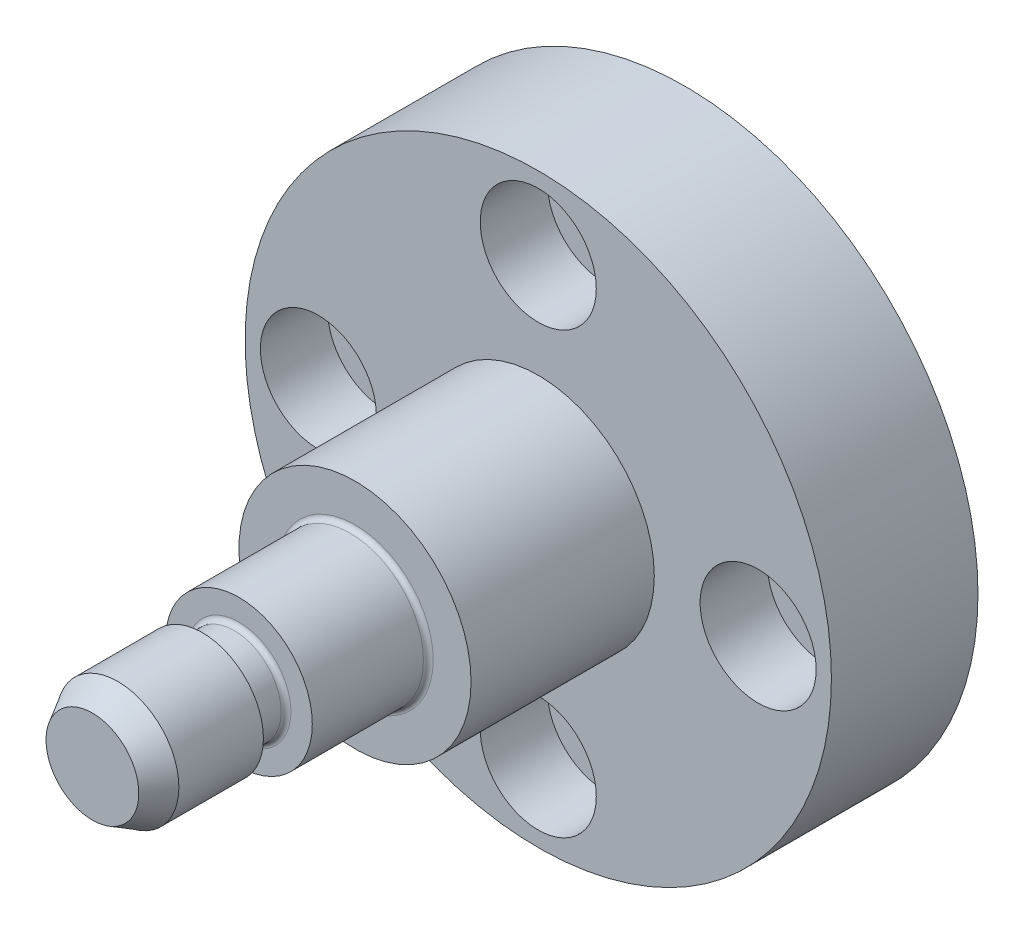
ISO-10303-21;
HEADER;
FILE_DESCRIPTION(('STEP AP214'),'2;1');
FILE_NAME('part.step','',(''),(''),'','','');
FILE_SCHEMA(('AUTOMOTIVE_DESIGN { 1 0 10303 214 1 1 1 1 }'));
ENDSEC;
DATA;
#1=APPLICATION_CONTEXT('core data for automotive mechanical design processes');
#2=APPLICATION_PROTOCOL_DEFINITION('international standard','automotive_design',2000,#1);
#3=PRODUCT_CONTEXT('',#1,'mechanical');
#4=PRODUCT('Part','Part','',(#3));
#5=PRODUCT_RELATED_PRODUCT_CATEGORY('part','',(#4));
#6=PRODUCT_DEFINITION_FORMATION('','',#4);
#7=PRODUCT_DEFINITION_CONTEXT('part definition',#1,'design');
#8=PRODUCT_DEFINITION('design','',#6,#7);
#9=PRODUCT_DEFINITION_SHAPE('','',#8);
#10=(LENGTH_UNIT() NAMED_UNIT(*) SI_UNIT(.MILLI.,.METRE.));
#11=(NAMED_UNIT(*) PLANE_ANGLE_UNIT() SI_UNIT($,.RADIAN.));
#12=(NAMED_UNIT(*) SI_UNIT($,.STERADIAN.) SOLID_ANGLE_UNIT());
#13=UNCERTAINTY_MEASURE_WITH_UNIT(LENGTH_MEASURE(1.E-05),#10,'distance_accuracy_value','');
#14=(GEOMETRIC_REPRESENTATION_CONTEXT(3) GLOBAL_UNCERTAINTY_ASSIGNED_CONTEXT((#13)) GLOBAL_UNIT_ASSIGNED_CONTEXT((#10,
#11,#12)) REPRESENTATION_CONTEXT('',''));
#15=CARTESIAN_POINT('',(0.,0.,0.));
#16=DIRECTION('',(0.,0.,1.));
#17=DIRECTION('',(1.,0.,0.));
#18=AXIS2_PLACEMENT_3D('',#15,#16,#17);
#19=CARTESIAN_POINT('',(-3.8456,-3.858832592,48.5));
#20=DIRECTION('',(0.,0.,1.));
#21=DIRECTION('',(1.,0.,0.));
#22=AXIS2_PLACEMENT_3D('',#19,#20,#21);
#23=PLANE('',#22);
#24=CARTESIAN_POINT('',(0.,0.,48.5));
#25=DIRECTION('',(0.,0.,-1.));
#26=DIRECTION('',(-1.,0.,0.));
#27=AXIS2_PLACEMENT_3D('',#24,#25,#26);
#28=CIRCLE('',#27,3.8);
#29=CARTESIAN_POINT('',(-3.8,0.,48.5));
#30=VERTEX_POINT('',#29);
#31=EDGE_CURVE('E16',#30,#30,#28,.T.);
#32=ORIENTED_EDGE('',*,*,#31,.F.);
#33=EDGE_LOOP('',(#32));
#34=FACE_BOUND('',#33,.T.);
#35=ADVANCED_FACE('F12',(#34),#23,.T.);
#36=CARTESIAN_POINT('',(0.,0.,48.5));
#37=DIRECTION('',(0.,0.,-1.));
#38=DIRECTION('',(-1.,0.,0.));
#39=AXIS2_PLACEMENT_3D('',#36,#37,#38);
#40=CONICAL_SURFACE('',#39,3.8,0.523598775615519);
#41=ORIENTED_EDGE('',*,*,#31,.T.);
#42=EDGE_LOOP('',(#41));
#43=FACE_BOUND('',#42,.T.);
#44=CARTESIAN_POINT('',(0.,0.,46.421539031));
#45=DIRECTION('',(0.,0.,1.));
#46=DIRECTION('',(1.,0.,0.));
#47=AXIS2_PLACEMENT_3D('',#44,#45,#46);
#48=CIRCLE('',#47,5.);
#49=CARTESIAN_POINT('',(5.,0.,46.421539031));
#50=VERTEX_POINT('',#49);
#51=EDGE_CURVE('E28',#50,#50,#48,.F.);
#52=ORIENTED_EDGE('',*,*,#51,.F.);
#53=EDGE_LOOP('',(#52));
#54=FACE_BOUND('',#53,.T.);
#55=ADVANCED_FACE('F107',(#43,#54),#40,.T.);
#56=CARTESIAN_POINT('',(0.,0.,39.5));
#57=DIRECTION('',(0.,0.,1.));
#58=DIRECTION('',(1.,0.,0.));
#59=AXIS2_PLACEMENT_3D('',#56,#57,#58);
#60=CYLINDRICAL_SURFACE('',#59,5.);
#61=CARTESIAN_POINT('',(0.,0.,39.5));
#62=DIRECTION('',(0.,0.,1.));
#63=DIRECTION('',(1.,0.,0.));
#64=AXIS2_PLACEMENT_3D('',#61,#62,#63);
#65=CIRCLE('',#64,5.);
#66=CARTESIAN_POINT('',(5.,0.,39.5));
#67=VERTEX_POINT('',#66);
#68=EDGE_CURVE('E97',#67,#67,#65,.F.);
#69=ORIENTED_EDGE('',*,*,#68,.F.);
#70=EDGE_LOOP('',(#69));
#71=FACE_BOUND('',#70,.T.);
#72=ORIENTED_EDGE('',*,*,#51,.T.);
#73=EDGE_LOOP('',(#72));
#74=FACE_BOUND('',#73,.T.);
#75=ADVANCED_FACE('F117',(#71,#74),#60,.T.);
#76=CARTESIAN_POINT('',(5.06,-5.077411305,39.5));
#77=DIRECTION('',(0.,0.,-1.));
#78=DIRECTION('',(-1.,0.,0.));
#79=AXIS2_PLACEMENT_3D('',#76,#77,#78);
#80=PLANE('',#79);
#81=CARTESIAN_POINT('',(0.,0.,39.5));
#82=DIRECTION('',(0.,0.,1.));
#83=DIRECTION('',(1.,0.,0.));
#84=AXIS2_PLACEMENT_3D('',#81,#82,#83);
#85=CIRCLE('',#84,3.85);
#86=CARTESIAN_POINT('',(3.85,0.,39.5));
#87=VERTEX_POINT('',#86);
#88=EDGE_CURVE('E95',#87,#87,#85,.F.);
#89=ORIENTED_EDGE('',*,*,#88,.F.);
#90=EDGE_LOOP('',(#89));
#91=FACE_BOUND('',#90,.T.);
#92=ORIENTED_EDGE('',*,*,#68,.T.);
#93=EDGE_LOOP('',(#92));
#94=FACE_BOUND('',#93,.T.);
#95=ADVANCED_FACE('F182',(#91,#94),#80,.T.);
#96=CARTESIAN_POINT('',(0.,0.,36.9));
#97=DIRECTION('',(0.,0.,1.));
#98=DIRECTION('',(1.,0.,0.));
#99=AXIS2_PLACEMENT_3D('',#96,#97,#98);
#100=CYLINDRICAL_SURFACE('',#99,3.85);
#101=CARTESIAN_POINT('',(0.,0.,36.9));
#102=DIRECTION('',(0.,0.,1.));
#103=DIRECTION('',(1.,0.,0.));
#104=AXIS2_PLACEMENT_3D('',#101,#102,#103);
#105=CIRCLE('',#104,3.85);
#106=CARTESIAN_POINT('',(3.85,0.,36.9));
#107=VERTEX_POINT('',#106);
#108=EDGE_CURVE('E94',#107,#107,#105,.T.);
#109=ORIENTED_EDGE('',*,*,#108,.T.);
#110=EDGE_LOOP('',(#109));
#111=FACE_BOUND('',#110,.T.);
#112=ORIENTED_EDGE('',*,*,#88,.T.);
#113=EDGE_LOOP('',(#112));
#114=FACE_BOUND('',#113,.T.);
#115=ADVANCED_FACE('F178',(#111,#114),#100,.T.);
#116=CARTESIAN_POINT('',(0.,0.,36.9));
#117=DIRECTION('',(0.,0.,1.));
#118=DIRECTION('',(1.,0.,0.));
#119=AXIS2_PLACEMENT_3D('',#116,#117,#118);
#120=TOROIDAL_SURFACE('',#119,4.25,0.4);
#121=CARTESIAN_POINT('',(0.,0.,36.5));
#122=DIRECTION('',(0.,0.,1.));
#123=DIRECTION('',(1.,0.,0.));
#124=AXIS2_PLACEMENT_3D('',#121,#122,#123);
#125=CIRCLE('',#124,4.250000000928);
#126=CARTESIAN_POINT('',(4.250000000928,0.,36.5));
#127=VERTEX_POINT('',#126);
#128=EDGE_CURVE('E91',#127,#127,#125,.F.);
#129=ORIENTED_EDGE('',*,*,#128,.F.);
#130=EDGE_LOOP('',(#129));
#131=FACE_BOUND('',#130,.T.);
#132=ORIENTED_EDGE('',*,*,#108,.F.);
#133=EDGE_LOOP('',(#132));
#134=FACE_BOUND('',#133,.T.);
#135=ADVANCED_FACE('F181',(#131,#134),#120,.F.);
#136=CARTESIAN_POINT('',(-6.072,-6.092893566,36.5));
#137=DIRECTION('',(0.,0.,1.));
#138=DIRECTION('',(1.,0.,0.));
#139=AXIS2_PLACEMENT_3D('',#136,#137,#138);
#140=PLANE('',#139);
#141=ORIENTED_EDGE('',*,*,#128,.T.);
#142=EDGE_LOOP('',(#141));
#143=FACE_BOUND('',#142,.T.);
#144=CARTESIAN_POINT('',(0.,0.,36.5));
#145=DIRECTION('',(0.,0.,1.));
#146=DIRECTION('',(1.,0.,0.));
#147=AXIS2_PLACEMENT_3D('',#144,#145,#146);
#148=CIRCLE('',#147,6.);
#149=CARTESIAN_POINT('',(6.,0.,36.5));
#150=VERTEX_POINT('',#149);
#151=EDGE_CURVE('E88',#150,#150,#148,.F.);
#152=ORIENTED_EDGE('',*,*,#151,.F.);
#153=EDGE_LOOP('',(#152));
#154=FACE_BOUND('',#153,.T.);
#155=ADVANCED_FACE('F176',(#143,#154),#140,.T.);
#156=CARTESIAN_POINT('',(0.,0.,27.4));
#157=DIRECTION('',(0.,0.,1.));
#158=DIRECTION('',(1.,0.,0.));
#159=AXIS2_PLACEMENT_3D('',#156,#157,#158);
#160=CYLINDRICAL_SURFACE('',#159,6.);
#161=CARTESIAN_POINT('',(0.,0.,27.4));
#162=DIRECTION('',(0.,0.,1.));
#163=DIRECTION('',(1.,0.,0.));
#164=AXIS2_PLACEMENT_3D('',#161,#162,#163);
#165=CIRCLE('',#164,6.);
#166=CARTESIAN_POINT('',(6.,0.,27.4));
#167=VERTEX_POINT('',#166);
#168=EDGE_CURVE('E87',#167,#167,#165,.T.);
#169=ORIENTED_EDGE('',*,*,#168,.T.);
#170=EDGE_LOOP('',(#169));
#171=FACE_BOUND('',#170,.T.);
#172=ORIENTED_EDGE('',*,*,#151,.T.);
#173=EDGE_LOOP('',(#172));
#174=FACE_BOUND('',#173,.T.);
#175=ADVANCED_FACE('F172',(#171,#174),#160,.T.);
#176=CARTESIAN_POINT('',(0.,0.,27.4));
#177=DIRECTION('',(0.,0.,1.));
#178=DIRECTION('',(1.,0.,0.));
#179=AXIS2_PLACEMENT_3D('',#176,#177,#178);
#180=TOROIDAL_SURFACE('',#179,6.4,0.4);
#181=CARTESIAN_POINT('',(0.,0.,27.));
#182=DIRECTION('',(0.,0.,1.));
#183=DIRECTION('',(1.,0.,0.));
#184=AXIS2_PLACEMENT_3D('',#181,#182,#183);
#185=CIRCLE('',#184,6.39999999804);
#186=CARTESIAN_POINT('',(6.39999999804,0.,27.));
#187=VERTEX_POINT('',#186);
#188=EDGE_CURVE('E84',#187,#187,#185,.F.);
#189=ORIENTED_EDGE('',*,*,#188,.F.);
#190=EDGE_LOOP('',(#189));
#191=FACE_BOUND('',#190,.T.);
#192=ORIENTED_EDGE('',*,*,#168,.F.);
#193=EDGE_LOOP('',(#192));
#194=FACE_BOUND('',#193,.T.);
#195=ADVANCED_FACE('F175',(#191,#194),#180,.F.);
#196=CARTESIAN_POINT('',(-9.614,-9.64708148,27.));
#197=DIRECTION('',(0.,0.,1.));
#198=DIRECTION('',(1.,0.,0.));
#199=AXIS2_PLACEMENT_3D('',#196,#197,#198);
#200=PLANE('',#199);
#201=ORIENTED_EDGE('',*,*,#188,.T.);
#202=EDGE_LOOP('',(#201));
#203=FACE_BOUND('',#202,.T.);
#204=CARTESIAN_POINT('',(0.,0.,27.));
#205=DIRECTION('',(0.,0.,1.));
#206=DIRECTION('',(1.,0.,0.));
#207=AXIS2_PLACEMENT_3D('',#204,#205,#206);
#208=CIRCLE('',#207,9.5);
#209=CARTESIAN_POINT('',(9.5,0.,27.));
#210=VERTEX_POINT('',#209);
#211=EDGE_CURVE('E81',#210,#210,#208,.F.);
#212=ORIENTED_EDGE('',*,*,#211,.F.);
#213=EDGE_LOOP('',(#212));
#214=FACE_BOUND('',#213,.T.);
#215=ADVANCED_FACE('F170',(#203,#214),#200,.T.);
#216=CARTESIAN_POINT('',(0.,0.,12.));
#217=DIRECTION('',(0.,0.,1.));
#218=DIRECTION('',(1.,0.,0.));
#219=AXIS2_PLACEMENT_3D('',#216,#217,#218);
#220=CYLINDRICAL_SURFACE('',#219,9.5);
#221=CARTESIAN_POINT('',(0.,0.,12.));
#222=DIRECTION('',(0.,0.,1.));
#223=DIRECTION('',(1.,0.,0.));
#224=AXIS2_PLACEMENT_3D('',#221,#222,#223);
#225=CIRCLE('',#224,9.5);
#226=CARTESIAN_POINT('',(9.5,0.,12.));
#227=VERTEX_POINT('',#226);
#228=EDGE_CURVE('E69',#227,#227,#225,.F.);
#229=ORIENTED_EDGE('',*,*,#228,.F.);
#230=EDGE_LOOP('',(#229));
#231=FACE_BOUND('',#230,.T.);
#232=ORIENTED_EDGE('',*,*,#211,.T.);
#233=EDGE_LOOP('',(#232));
#234=FACE_BOUND('',#233,.T.);
#235=ADVANCED_FACE('F166',(#231,#234),#220,.T.);
#236=CARTESIAN_POINT('',(0.,-18.,6.5));
#237=DIRECTION('',(0.,0.,1.));
#238=DIRECTION('',(1.,0.,0.));
#239=AXIS2_PLACEMENT_3D('',#236,#237,#238);
#240=CYLINDRICAL_SURFACE('',#239,4.75);
#241=CARTESIAN_POINT('',(0.,-18.,6.5));
#242=DIRECTION('',(0.,0.,1.));
#243=DIRECTION('',(1.,0.,0.));
#244=AXIS2_PLACEMENT_3D('',#241,#242,#243);
#245=CIRCLE('',#244,4.75);
#246=CARTESIAN_POINT('',(4.75,-18.,6.5));
#247=VERTEX_POINT('',#246);
#248=EDGE_CURVE('E66',#247,#247,#245,.F.);
#249=ORIENTED_EDGE('',*,*,#248,.T.);
#250=EDGE_LOOP('',(#249));
#251=FACE_BOUND('',#250,.T.);
#252=CARTESIAN_POINT('',(0.,-18.,12.));
#253=DIRECTION('',(0.,0.,1.));
#254=DIRECTION('',(1.,0.,0.));
#255=AXIS2_PLACEMENT_3D('',#252,#253,#254);
#256=CIRCLE('',#255,4.75);
#257=CARTESIAN_POINT('',(4.75,-18.,12.));
#258=VERTEX_POINT('',#257);
#259=EDGE_CURVE('E78',#258,#258,#256,.F.);
#260=ORIENTED_EDGE('',*,*,#259,.F.);
#261=EDGE_LOOP('',(#260));
#262=FACE_BOUND('',#261,.T.);
#263=ADVANCED_FACE('F162',(#251,#262),#240,.F.);
#264=CARTESIAN_POINT('',(-18.,0.,6.5));
#265=DIRECTION('',(0.,0.,1.));
#266=DIRECTION('',(1.,0.,0.));
#267=AXIS2_PLACEMENT_3D('',#264,#265,#266);
#268=CYLINDRICAL_SURFACE('',#267,4.75);
#269=CARTESIAN_POINT('',(-18.,0.,6.5));
#270=DIRECTION('',(0.,0.,1.));
#271=DIRECTION('',(1.,0.,0.));
#272=AXIS2_PLACEMENT_3D('',#269,#270,#271);
#273=CIRCLE('',#272,4.75);
#274=CARTESIAN_POINT('',(-13.25,0.,6.5));
#275=VERTEX_POINT('',#274);
#276=EDGE_CURVE('E63',#275,#275,#273,.F.);
#277=ORIENTED_EDGE('',*,*,#276,.T.);
#278=EDGE_LOOP('',(#277));
#279=FACE_BOUND('',#278,.T.);
#280=CARTESIAN_POINT('',(-18.,0.,12.));
#281=DIRECTION('',(0.,0.,1.));
#282=DIRECTION('',(1.,0.,0.));
#283=AXIS2_PLACEMENT_3D('',#280,#281,#282);
#284=CIRCLE('',#283,4.75);
#285=CARTESIAN_POINT('',(-13.25,0.,12.));
#286=VERTEX_POINT('',#285);
#287=EDGE_CURVE('E75',#286,#286,#284,.F.);
#288=ORIENTED_EDGE('',*,*,#287,.F.);
#289=EDGE_LOOP('',(#288));
#290=FACE_BOUND('',#289,.T.);
#291=ADVANCED_FACE('F158',(#279,#290),#268,.F.);
#292=CARTESIAN_POINT('',(0.,18.,6.5));
#293=DIRECTION('',(0.,0.,1.));
#294=DIRECTION('',(1.,0.,0.));
#295=AXIS2_PLACEMENT_3D('',#292,#293,#294);
#296=CYLINDRICAL_SURFACE('',#295,4.75);
#297=CARTESIAN_POINT('',(0.,18.,6.5));
#298=DIRECTION('',(0.,0.,1.));
#299=DIRECTION('',(1.,0.,0.));
#300=AXIS2_PLACEMENT_3D('',#297,#298,#299);
#301=CIRCLE('',#300,4.75);
#302=CARTESIAN_POINT('',(4.75,18.,6.5));
#303=VERTEX_POINT('',#302);
#304=EDGE_CURVE('E60',#303,#303,#301,.F.);
#305=ORIENTED_EDGE('',*,*,#304,.T.);
#306=EDGE_LOOP('',(#305));
#307=FACE_BOUND('',#306,.T.);
#308=CARTESIAN_POINT('',(0.,18.,12.));
#309=DIRECTION('',(0.,0.,1.));
#310=DIRECTION('',(1.,0.,0.));
#311=AXIS2_PLACEMENT_3D('',#308,#309,#310);
#312=CIRCLE('',#311,4.75);
#313=CARTESIAN_POINT('',(4.75,18.,12.));
#314=VERTEX_POINT('',#313);
#315=EDGE_CURVE('E72',#314,#314,#312,.F.);
#316=ORIENTED_EDGE('',*,*,#315,.F.);
#317=EDGE_LOOP('',(#316));
#318=FACE_BOUND('',#317,.T.);
#319=ADVANCED_FACE('F154',(#307,#318),#296,.F.);
#320=CARTESIAN_POINT('',(-24.288,-24.371574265,12.));
#321=DIRECTION('',(0.,0.,1.));
#322=DIRECTION('',(1.,0.,0.));
#323=AXIS2_PLACEMENT_3D('',#320,#321,#322);
#324=PLANE('',#323);
#325=ORIENTED_EDGE('',*,*,#228,.T.);
#326=EDGE_LOOP('',(#325));
#327=FACE_BOUND('',#326,.T.);
#328=ORIENTED_EDGE('',*,*,#315,.T.);
#329=EDGE_LOOP('',(#328));
#330=FACE_BOUND('',#329,.T.);
#331=ORIENTED_EDGE('',*,*,#287,.T.);
#332=EDGE_LOOP('',(#331));
#333=FACE_BOUND('',#332,.T.);
#334=ORIENTED_EDGE('',*,*,#259,.T.);
#335=EDGE_LOOP('',(#334));
#336=FACE_BOUND('',#335,.T.);
#337=CARTESIAN_POINT('',(18.,0.,12.));
#338=DIRECTION('',(0.,0.,1.));
#339=DIRECTION('',(1.,0.,0.));
#340=AXIS2_PLACEMENT_3D('',#337,#338,#339);
#341=CIRCLE('',#340,4.75);
#342=CARTESIAN_POINT('',(22.75,0.,12.));
#343=VERTEX_POINT('',#342);
#344=EDGE_CURVE('E57',#343,#343,#341,.F.);
#345=ORIENTED_EDGE('',*,*,#344,.T.);
#346=EDGE_LOOP('',(#345));
#347=FACE_BOUND('',#346,.T.);
#348=CARTESIAN_POINT('',(0.,0.,12.));
#349=DIRECTION('',(0.,0.,1.));
#350=DIRECTION('',(1.,0.,0.));
#351=AXIS2_PLACEMENT_3D('',#348,#349,#350);
#352=CIRCLE('',#351,24.);
#353=CARTESIAN_POINT('',(24.,0.,12.));
#354=VERTEX_POINT('',#353);
#355=EDGE_CURVE('E54',#354,#354,#352,.F.);
#356=ORIENTED_EDGE('',*,*,#355,.F.);
#357=EDGE_LOOP('',(#356));
#358=FACE_BOUND('',#357,.T.);
#359=ADVANCED_FACE('F157',(#327,#330,#333,#336,#347,#358),#324,.T.);
#360=CARTESIAN_POINT('',(4.82354074,-13.193,6.5));
#361=DIRECTION('',(0.,0.,-1.));
#362=DIRECTION('',(0.,-1.,0.));
#363=AXIS2_PLACEMENT_3D('',#360,#361,#362);
#364=PLANE('',#363);
#365=CARTESIAN_POINT('',(0.,-18.,6.5));
#366=DIRECTION('',(0.,0.,1.));
#367=DIRECTION('',(1.,0.,0.));
#368=AXIS2_PLACEMENT_3D('',#365,#366,#367);
#369=CIRCLE('',#368,3.);
#370=CARTESIAN_POINT('',(3.,-18.,6.5));
#371=VERTEX_POINT('',#370);
#372=EDGE_CURVE('E51',#371,#371,#369,.F.);
#373=ORIENTED_EDGE('',*,*,#372,.T.);
#374=EDGE_LOOP('',(#373));
#375=FACE_BOUND('',#374,.T.);
#376=ORIENTED_EDGE('',*,*,#248,.F.);
#377=EDGE_LOOP('',(#376));
#378=FACE_BOUND('',#377,.T.);
#379=ADVANCED_FACE('F210',(#375,#378),#364,.F.);
#380=CARTESIAN_POINT('',(-13.193,-4.82354074,6.5));
#381=DIRECTION('',(0.,0.,-1.));
#382=DIRECTION('',(-1.,0.,0.));
#383=AXIS2_PLACEMENT_3D('',#380,#381,#382);
#384=PLANE('',#383);
#385=CARTESIAN_POINT('',(-18.,0.,6.5));
#386=DIRECTION('',(0.,0.,1.));
#387=DIRECTION('',(1.,0.,0.));
#388=AXIS2_PLACEMENT_3D('',#385,#386,#387);
#389=CIRCLE('',#388,3.);
#390=CARTESIAN_POINT('',(-15.,0.,6.5));
#391=VERTEX_POINT('',#390);
#392=EDGE_CURVE('E48',#391,#391,#389,.F.);
#393=ORIENTED_EDGE('',*,*,#392,.T.);
#394=EDGE_LOOP('',(#393));
#395=FACE_BOUND('',#394,.T.);
#396=ORIENTED_EDGE('',*,*,#276,.F.);
#397=EDGE_LOOP('',(#396));
#398=FACE_BOUND('',#397,.T.);
#399=ADVANCED_FACE('F214',(#395,#398),#384,.F.);
#400=CARTESIAN_POINT('',(-4.82354074,13.193,6.5));
#401=DIRECTION('',(0.,0.,-1.));
#402=DIRECTION('',(0.,1.,0.));
#403=AXIS2_PLACEMENT_3D('',#400,#401,#402);
#404=PLANE('',#403);
#405=CARTESIAN_POINT('',(0.,18.,6.5));
#406=DIRECTION('',(0.,0.,1.));
#407=DIRECTION('',(1.,0.,0.));
#408=AXIS2_PLACEMENT_3D('',#405,#406,#407);
#409=CIRCLE('',#408,3.);
#410=CARTESIAN_POINT('',(3.,18.,6.5));
#411=VERTEX_POINT('',#410);
#412=EDGE_CURVE('E45',#411,#411,#409,.F.);
#413=ORIENTED_EDGE('',*,*,#412,.T.);
#414=EDGE_LOOP('',(#413));
#415=FACE_BOUND('',#414,.T.);
#416=ORIENTED_EDGE('',*,*,#304,.F.);
#417=EDGE_LOOP('',(#416));
#418=FACE_BOUND('',#417,.T.);
#419=ADVANCED_FACE('F152',(#415,#418),#404,.F.);
#420=CARTESIAN_POINT('',(18.,0.,6.5));
#421=DIRECTION('',(0.,0.,1.));
#422=DIRECTION('',(1.,0.,0.));
#423=AXIS2_PLACEMENT_3D('',#420,#421,#422);
#424=CYLINDRICAL_SURFACE('',#423,4.75);
#425=CARTESIAN_POINT('',(18.,0.,6.5));
#426=DIRECTION('',(0.,0.,1.));
#427=DIRECTION('',(1.,0.,0.));
#428=AXIS2_PLACEMENT_3D('',#425,#426,#427);
#429=CIRCLE('',#428,4.75);
#430=CARTESIAN_POINT('',(22.75,0.,6.5));
#431=VERTEX_POINT('',#430);
#432=EDGE_CURVE('E42',#431,#431,#429,.F.);
#433=ORIENTED_EDGE('',*,*,#432,.T.);
#434=EDGE_LOOP('',(#433));
#435=FACE_BOUND('',#434,.T.);
#436=ORIENTED_EDGE('',*,*,#344,.F.);
#437=EDGE_LOOP('',(#436));
#438=FACE_BOUND('',#437,.T.);
#439=ADVANCED_FACE('F148',(#435,#438),#424,.F.);
#440=CARTESIAN_POINT('',(0.,0.,0.));
#441=DIRECTION('',(0.,0.,1.));
#442=DIRECTION('',(1.,0.,0.));
#443=AXIS2_PLACEMENT_3D('',#440,#441,#442);
#444=CYLINDRICAL_SURFACE('',#443,24.);
#445=CARTESIAN_POINT('',(0.,0.,0.));
#446=DIRECTION('',(0.,0.,1.));
#447=DIRECTION('',(1.,0.,0.));
#448=AXIS2_PLACEMENT_3D('',#445,#446,#447);
#449=CIRCLE('',#448,24.);
#450=CARTESIAN_POINT('',(24.,0.,0.));
#451=VERTEX_POINT('',#450);
#452=EDGE_CURVE('E39',#451,#451,#449,.F.);
#453=ORIENTED_EDGE('',*,*,#452,.F.);
#454=EDGE_LOOP('',(#453));
#455=FACE_BOUND('',#454,.T.);
#456=ORIENTED_EDGE('',*,*,#355,.T.);
#457=EDGE_LOOP('',(#456));
#458=FACE_BOUND('',#457,.T.);
#459=ADVANCED_FACE('F144',(#455,#458),#444,.T.);
#460=CARTESIAN_POINT('',(0.,-18.,0.));
#461=DIRECTION('',(0.,0.,1.));
#462=DIRECTION('',(1.,0.,0.));
#463=AXIS2_PLACEMENT_3D('',#460,#461,#462);
#464=CYLINDRICAL_SURFACE('',#463,3.);
#465=ORIENTED_EDGE('',*,*,#372,.F.);
#466=EDGE_LOOP('',(#465));
#467=FACE_BOUND('',#466,.T.);
#468=CARTESIAN_POINT('',(0.,-18.,0.));
#469=DIRECTION('',(0.,0.,1.));
#470=DIRECTION('',(1.,0.,0.));
#471=AXIS2_PLACEMENT_3D('',#468,#469,#470);
#472=CIRCLE('',#471,3.);
#473=CARTESIAN_POINT('',(3.,-18.,0.));
#474=VERTEX_POINT('',#473);
#475=EDGE_CURVE('E36',#474,#474,#472,.T.);
#476=ORIENTED_EDGE('',*,*,#475,.F.);
#477=EDGE_LOOP('',(#476));
#478=FACE_BOUND('',#477,.T.);
#479=ADVANCED_FACE('F140',(#467,#478),#464,.F.);
#480=CARTESIAN_POINT('',(-18.,0.,0.));
#481=DIRECTION('',(0.,0.,1.));
#482=DIRECTION('',(1.,0.,0.));
#483=AXIS2_PLACEMENT_3D('',#480,#481,#482);
#484=CYLINDRICAL_SURFACE('',#483,3.);
#485=ORIENTED_EDGE('',*,*,#392,.F.);
#486=EDGE_LOOP('',(#485));
#487=FACE_BOUND('',#486,.T.);
#488=CARTESIAN_POINT('',(-18.,0.,0.));
#489=DIRECTION('',(0.,0.,1.));
#490=DIRECTION('',(1.,0.,0.));
#491=AXIS2_PLACEMENT_3D('',#488,#489,#490);
#492=CIRCLE('',#491,3.);
#493=CARTESIAN_POINT('',(-15.,0.,0.));
#494=VERTEX_POINT('',#493);
#495=EDGE_CURVE('E33',#494,#494,#492,.T.);
#496=ORIENTED_EDGE('',*,*,#495,.F.);
#497=EDGE_LOOP('',(#496));
#498=FACE_BOUND('',#497,.T.);
#499=ADVANCED_FACE('F136',(#487,#498),#484,.F.);
#500=CARTESIAN_POINT('',(0.,18.,0.));
#501=DIRECTION('',(0.,0.,1.));
#502=DIRECTION('',(1.,0.,0.));
#503=AXIS2_PLACEMENT_3D('',#500,#501,#502);
#504=CYLINDRICAL_SURFACE('',#503,3.);
#505=ORIENTED_EDGE('',*,*,#412,.F.);
#506=EDGE_LOOP('',(#505));
#507=FACE_BOUND('',#506,.T.);
#508=CARTESIAN_POINT('',(0.,18.,0.));
#509=DIRECTION('',(0.,0.,1.));
#510=DIRECTION('',(1.,0.,0.));
#511=AXIS2_PLACEMENT_3D('',#508,#509,#510);
#512=CIRCLE('',#511,3.);
#513=CARTESIAN_POINT('',(3.,18.,0.));
#514=VERTEX_POINT('',#513);
#515=EDGE_CURVE('E25',#514,#514,#512,.T.);
#516=ORIENTED_EDGE('',*,*,#515,.F.);
#517=EDGE_LOOP('',(#516));
#518=FACE_BOUND('',#517,.T.);
#519=ADVANCED_FACE('F133',(#507,#518),#504,.F.);
#520=CARTESIAN_POINT('',(13.193,4.82354074,6.5));
#521=DIRECTION('',(0.,0.,-1.));
#522=DIRECTION('',(1.,0.,0.));
#523=AXIS2_PLACEMENT_3D('',#520,#521,#522);
#524=PLANE('',#523);
#525=CARTESIAN_POINT('',(18.,0.,6.5));
#526=DIRECTION('',(0.,0.,1.));
#527=DIRECTION('',(1.,0.,0.));
#528=AXIS2_PLACEMENT_3D('',#525,#526,#527);
#529=CIRCLE('',#528,3.);
#530=CARTESIAN_POINT('',(21.,0.,6.5));
#531=VERTEX_POINT('',#530);
#532=EDGE_CURVE('E20',#531,#531,#529,.F.);
#533=ORIENTED_EDGE('',*,*,#532,.T.);
#534=EDGE_LOOP('',(#533));
#535=FACE_BOUND('',#534,.T.);
#536=ORIENTED_EDGE('',*,*,#432,.F.);
#537=EDGE_LOOP('',(#536));
#538=FACE_BOUND('',#537,.T.);
#539=ADVANCED_FACE('F128',(#535,#538),#524,.F.);
#540=CARTESIAN_POINT('',(24.288,-24.371574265,0.));
#541=DIRECTION('',(0.,0.,-1.));
#542=DIRECTION('',(-1.,0.,0.));
#543=AXIS2_PLACEMENT_3D('',#540,#541,#542);
#544=PLANE('',#543);
#545=ORIENTED_EDGE('',*,*,#515,.T.);
#546=EDGE_LOOP('',(#545));
#547=FACE_BOUND('',#546,.T.);
#548=ORIENTED_EDGE('',*,*,#495,.T.);
#549=EDGE_LOOP('',(#548));
#550=FACE_BOUND('',#549,.T.);
#551=ORIENTED_EDGE('',*,*,#475,.T.);
#552=EDGE_LOOP('',(#551));
#553=FACE_BOUND('',#552,.T.);
#554=CARTESIAN_POINT('',(18.,0.,0.));
#555=DIRECTION('',(0.,0.,1.));
#556=DIRECTION('',(1.,0.,0.));
#557=AXIS2_PLACEMENT_3D('',#554,#555,#556);
#558=CIRCLE('',#557,3.);
#559=CARTESIAN_POINT('',(21.,0.,0.));
#560=VERTEX_POINT('',#559);
#561=EDGE_CURVE('E8',#560,#560,#558,.T.);
#562=ORIENTED_EDGE('',*,*,#561,.T.);
#563=EDGE_LOOP('',(#562));
#564=FACE_BOUND('',#563,.T.);
#565=ORIENTED_EDGE('',*,*,#452,.T.);
#566=EDGE_LOOP('',(#565));
#567=FACE_BOUND('',#566,.T.);
#568=ADVANCED_FACE('F14',(#547,#550,#553,#564,#567),#544,.T.);
#569=CARTESIAN_POINT('',(18.,0.,0.));
#570=DIRECTION('',(0.,0.,1.));
#571=DIRECTION('',(1.,0.,0.));
#572=AXIS2_PLACEMENT_3D('',#569,#570,#571);
#573=CYLINDRICAL_SURFACE('',#572,3.);
#574=ORIENTED_EDGE('',*,*,#532,.F.);
#575=EDGE_LOOP('',(#574));
#576=FACE_BOUND('',#575,.T.);
#577=ORIENTED_EDGE('',*,*,#561,.F.);
#578=EDGE_LOOP('',(#577));
#579=FACE_BOUND('',#578,.T.);
#580=ADVANCED_FACE('F121',(#576,#579),#573,.F.);
#581=CLOSED_SHELL('',(#35,#55,#75,#95,#115,#135,#155,#175,#195,#215,#235,#263,#291,#319,#359,
#379,#399,#419,#439,#459,#479,#499,#519,#539,#568,#580));
#582=MANIFOLD_SOLID_BREP('B1',#581);
#583=ADVANCED_BREP_SHAPE_REPRESENTATION('',(#18,#582),#14);
#584=SHAPE_DEFINITION_REPRESENTATION(#9,#583);
ENDSEC;
END-ISO-10303-21;
